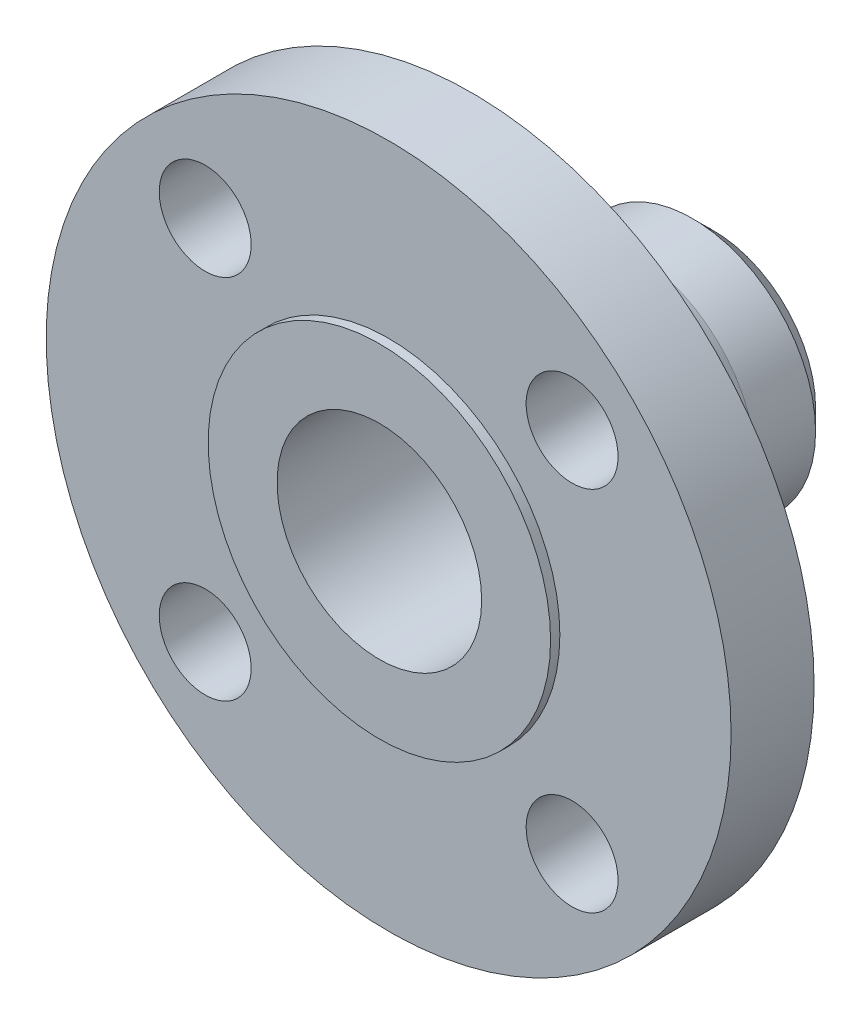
ISO-10303-21;
HEADER;
FILE_DESCRIPTION(('STEP AP214'),'2;1');
FILE_NAME('part.step','',(''),(''),'','','');
FILE_SCHEMA(('AUTOMOTIVE_DESIGN { 1 0 10303 214 1 1 1 1 }'));
ENDSEC;
DATA;
#1=APPLICATION_CONTEXT('core data for automotive mechanical design processes');
#2=APPLICATION_PROTOCOL_DEFINITION('international standard','automotive_design',2000,#1);
#3=PRODUCT_CONTEXT('',#1,'mechanical');
#4=PRODUCT('Part','Part','',(#3));
#5=PRODUCT_RELATED_PRODUCT_CATEGORY('part','',(#4));
#6=PRODUCT_DEFINITION_FORMATION('','',#4);
#7=PRODUCT_DEFINITION_CONTEXT('part definition',#1,'design');
#8=PRODUCT_DEFINITION('design','',#6,#7);
#9=PRODUCT_DEFINITION_SHAPE('','',#8);
#10=(LENGTH_UNIT() NAMED_UNIT(*) SI_UNIT(.MILLI.,.METRE.));
#11=(NAMED_UNIT(*) PLANE_ANGLE_UNIT() SI_UNIT($,.RADIAN.));
#12=(NAMED_UNIT(*) SI_UNIT($,.STERADIAN.) SOLID_ANGLE_UNIT());
#13=UNCERTAINTY_MEASURE_WITH_UNIT(LENGTH_MEASURE(1.E-05),#10,'distance_accuracy_value','');
#14=(GEOMETRIC_REPRESENTATION_CONTEXT(3) GLOBAL_UNCERTAINTY_ASSIGNED_CONTEXT((#13)) GLOBAL_UNIT_ASSIGNED_CONTEXT((#10,
#11,#12)) REPRESENTATION_CONTEXT('',''));
#15=CARTESIAN_POINT('',(0.,0.,0.));
#16=DIRECTION('',(0.,0.,1.));
#17=DIRECTION('',(1.,0.,0.));
#18=AXIS2_PLACEMENT_3D('',#15,#16,#17);
#19=CARTESIAN_POINT('',(0.,0.,1.5875));
#20=DIRECTION('',(0.,0.,1.));
#21=DIRECTION('',(1.,0.,0.));
#22=AXIS2_PLACEMENT_3D('',#19,#20,#21);
#23=PLANE('',#22);
#24=CARTESIAN_POINT('',(0.,0.,1.5875));
#25=DIRECTION('',(0.,0.,1.));
#26=DIRECTION('',(1.,0.,0.));
#27=AXIS2_PLACEMENT_3D('',#24,#25,#26);
#28=CIRCLE('',#27,29.337);
#29=CARTESIAN_POINT('',(29.337,0.,1.5875));
#30=VERTEX_POINT('',#29);
#31=EDGE_CURVE('E40',#30,#30,#28,.T.);
#32=ORIENTED_EDGE('',*,*,#31,.T.);
#33=EDGE_LOOP('',(#32));
#34=FACE_BOUND('',#33,.T.);
#35=CARTESIAN_POINT('',(0.,0.,1.5875));
#36=DIRECTION('',(0.,0.,1.));
#37=DIRECTION('',(1.,0.,0.));
#38=AXIS2_PLACEMENT_3D('',#35,#36,#37);
#39=CIRCLE('',#38,17.526);
#40=CARTESIAN_POINT('',(17.526,0.,1.5875));
#41=VERTEX_POINT('',#40);
#42=EDGE_CURVE('E61',#41,#41,#39,.T.);
#43=ORIENTED_EDGE('',*,*,#42,.F.);
#44=EDGE_LOOP('',(#43));
#45=FACE_BOUND('',#44,.T.);
#46=ADVANCED_FACE('F32',(#34,#45),#23,.T.);
#47=CARTESIAN_POINT('',(0.,0.,1.5875));
#48=DIRECTION('',(0.,0.,-1.));
#49=DIRECTION('',(-1.,0.,0.));
#50=AXIS2_PLACEMENT_3D('',#47,#48,#49);
#51=CYLINDRICAL_SURFACE('',#50,29.337);
#52=ORIENTED_EDGE('',*,*,#31,.F.);
#53=EDGE_LOOP('',(#52));
#54=FACE_BOUND('',#53,.T.);
#55=CARTESIAN_POINT('',(0.,0.,0.));
#56=DIRECTION('',(0.,0.,1.));
#57=DIRECTION('',(1.,0.,0.));
#58=AXIS2_PLACEMENT_3D('',#55,#56,#57);
#59=CIRCLE('',#58,29.337);
#60=CARTESIAN_POINT('',(29.337,0.,0.));
#61=VERTEX_POINT('',#60);
#62=EDGE_CURVE('E44',#61,#61,#59,.T.);
#63=ORIENTED_EDGE('',*,*,#62,.T.);
#64=EDGE_LOOP('',(#63));
#65=FACE_BOUND('',#64,.T.);
#66=ADVANCED_FACE('F96',(#54,#65),#51,.T.);
#67=CARTESIAN_POINT('',(0.,0.,0.));
#68=DIRECTION('',(0.,0.,1.));
#69=DIRECTION('',(1.,0.,0.));
#70=AXIS2_PLACEMENT_3D('',#67,#68,#69);
#71=PLANE('',#70);
#72=CARTESIAN_POINT('',(31.4308964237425,-31.4308964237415,0.));
#73=DIRECTION('',(0.,0.,1.));
#74=DIRECTION('',(0.,-1.,0.));
#75=AXIS2_PLACEMENT_3D('',#72,#73,#74);
#76=CIRCLE('',#75,7.87400000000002);
#77=CARTESIAN_POINT('',(31.4308964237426,-39.3048964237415,0.));
#78=VERTEX_POINT('',#77);
#79=EDGE_CURVE('E85',#78,#78,#76,.T.);
#80=ORIENTED_EDGE('',*,*,#79,.F.);
#81=EDGE_LOOP('',(#80));
#82=FACE_BOUND('',#81,.T.);
#83=CARTESIAN_POINT('',(-31.4308964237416,-31.4308964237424,0.));
#84=DIRECTION('',(0.,0.,1.));
#85=DIRECTION('',(-1.,0.,0.));
#86=AXIS2_PLACEMENT_3D('',#83,#84,#85);
#87=CIRCLE('',#86,7.87400000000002);
#88=CARTESIAN_POINT('',(-39.3048964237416,-31.4308964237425,0.));
#89=VERTEX_POINT('',#88);
#90=EDGE_CURVE('E79',#89,#89,#87,.T.);
#91=ORIENTED_EDGE('',*,*,#90,.F.);
#92=EDGE_LOOP('',(#91));
#93=FACE_BOUND('',#92,.T.);
#94=CARTESIAN_POINT('',(-31.4308964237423,31.4308964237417,0.));
#95=DIRECTION('',(0.,0.,1.));
#96=DIRECTION('',(0.,1.,0.));
#97=AXIS2_PLACEMENT_3D('',#94,#95,#96);
#98=CIRCLE('',#97,7.87400000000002);
#99=CARTESIAN_POINT('',(-31.4308964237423,39.3048964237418,0.));
#100=VERTEX_POINT('',#99);
#101=EDGE_CURVE('E73',#100,#100,#98,.T.);
#102=ORIENTED_EDGE('',*,*,#101,.F.);
#103=EDGE_LOOP('',(#102));
#104=FACE_BOUND('',#103,.T.);
#105=CARTESIAN_POINT('',(31.4308964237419,31.4308964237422,0.));
#106=DIRECTION('',(0.,0.,1.));
#107=DIRECTION('',(1.,0.,0.));
#108=AXIS2_PLACEMENT_3D('',#105,#106,#107);
#109=CIRCLE('',#108,7.87400000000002);
#110=CARTESIAN_POINT('',(39.3048964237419,31.4308964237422,0.));
#111=VERTEX_POINT('',#110);
#112=EDGE_CURVE('E67',#111,#111,#109,.T.);
#113=ORIENTED_EDGE('',*,*,#112,.F.);
#114=EDGE_LOOP('',(#113));
#115=FACE_BOUND('',#114,.T.);
#116=CARTESIAN_POINT('',(0.,0.,0.));
#117=DIRECTION('',(0.,0.,1.));
#118=DIRECTION('',(1.,0.,0.));
#119=AXIS2_PLACEMENT_3D('',#116,#117,#118);
#120=CIRCLE('',#119,58.674);
#121=CARTESIAN_POINT('',(58.674,0.,0.));
#122=VERTEX_POINT('',#121);
#123=EDGE_CURVE('E52',#122,#122,#120,.T.);
#124=ORIENTED_EDGE('',*,*,#123,.T.);
#125=EDGE_LOOP('',(#124));
#126=FACE_BOUND('',#125,.T.);
#127=ORIENTED_EDGE('',*,*,#62,.F.);
#128=EDGE_LOOP('',(#127));
#129=FACE_BOUND('',#128,.T.);
#130=ADVANCED_FACE('F92',(#82,#93,#104,#115,#126,#129),#71,.T.);
#131=CARTESIAN_POINT('',(0.,0.,-180.179133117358));
#132=DIRECTION('',(0.,0.,1.));
#133=DIRECTION('',(1.,0.,0.));
#134=AXIS2_PLACEMENT_3D('',#131,#132,#133);
#135=CYLINDRICAL_SURFACE('',#134,58.674);
#136=CARTESIAN_POINT('',(0.,0.,-14.224));
#137=DIRECTION('',(0.,0.,1.));
#138=DIRECTION('',(1.,0.,0.));
#139=AXIS2_PLACEMENT_3D('',#136,#137,#138);
#140=CIRCLE('',#139,58.674);
#141=CARTESIAN_POINT('',(58.674,0.,-14.224));
#142=VERTEX_POINT('',#141);
#143=EDGE_CURVE('E49',#142,#142,#140,.F.);
#144=ORIENTED_EDGE('',*,*,#143,.F.);
#145=EDGE_LOOP('',(#144));
#146=FACE_BOUND('',#145,.T.);
#147=ORIENTED_EDGE('',*,*,#123,.F.);
#148=EDGE_LOOP('',(#147));
#149=FACE_BOUND('',#148,.T.);
#150=ADVANCED_FACE('F95',(#146,#149),#135,.T.);
#151=CARTESIAN_POINT('',(0.,0.,-14.224));
#152=DIRECTION('',(0.,0.,1.));
#153=DIRECTION('',(1.,0.,0.));
#154=AXIS2_PLACEMENT_3D('',#151,#152,#153);
#155=PLANE('',#154);
#156=CARTESIAN_POINT('',(31.4308964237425,-31.4308964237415,-14.224));
#157=DIRECTION('',(0.,0.,1.));
#158=DIRECTION('',(0.,-1.,0.));
#159=AXIS2_PLACEMENT_3D('',#156,#157,#158);
#160=CIRCLE('',#159,7.87400000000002);
#161=CARTESIAN_POINT('',(31.4308964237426,-39.3048964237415,-14.224));
#162=VERTEX_POINT('',#161);
#163=EDGE_CURVE('E82',#162,#162,#160,.T.);
#164=ORIENTED_EDGE('',*,*,#163,.T.);
#165=EDGE_LOOP('',(#164));
#166=FACE_BOUND('',#165,.T.);
#167=CARTESIAN_POINT('',(-31.4308964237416,-31.4308964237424,-14.224));
#168=DIRECTION('',(0.,0.,1.));
#169=DIRECTION('',(-1.,0.,0.));
#170=AXIS2_PLACEMENT_3D('',#167,#168,#169);
#171=CIRCLE('',#170,7.87400000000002);
#172=CARTESIAN_POINT('',(-39.3048964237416,-31.4308964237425,-14.224));
#173=VERTEX_POINT('',#172);
#174=EDGE_CURVE('E76',#173,#173,#171,.T.);
#175=ORIENTED_EDGE('',*,*,#174,.T.);
#176=EDGE_LOOP('',(#175));
#177=FACE_BOUND('',#176,.T.);
#178=CARTESIAN_POINT('',(-31.4308964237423,31.4308964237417,-14.224));
#179=DIRECTION('',(0.,0.,1.));
#180=DIRECTION('',(0.,1.,0.));
#181=AXIS2_PLACEMENT_3D('',#178,#179,#180);
#182=CIRCLE('',#181,7.87400000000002);
#183=CARTESIAN_POINT('',(-31.4308964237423,39.3048964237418,-14.224));
#184=VERTEX_POINT('',#183);
#185=EDGE_CURVE('E70',#184,#184,#182,.T.);
#186=ORIENTED_EDGE('',*,*,#185,.T.);
#187=EDGE_LOOP('',(#186));
#188=FACE_BOUND('',#187,.T.);
#189=CARTESIAN_POINT('',(31.4308964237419,31.4308964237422,-14.224));
#190=DIRECTION('',(0.,0.,1.));
#191=DIRECTION('',(1.,0.,0.));
#192=AXIS2_PLACEMENT_3D('',#189,#190,#191);
#193=CIRCLE('',#192,7.87400000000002);
#194=CARTESIAN_POINT('',(39.3048964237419,31.4308964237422,-14.224));
#195=VERTEX_POINT('',#194);
#196=EDGE_CURVE('E36',#195,#195,#193,.T.);
#197=ORIENTED_EDGE('',*,*,#196,.T.);
#198=EDGE_LOOP('',(#197));
#199=FACE_BOUND('',#198,.T.);
#200=CARTESIAN_POINT('',(0.,0.,-14.224));
#201=DIRECTION('',(0.,0.,-1.));
#202=DIRECTION('',(-1.,0.,0.));
#203=AXIS2_PLACEMENT_3D('',#200,#201,#202);
#204=CIRCLE('',#203,29.337);
#205=CARTESIAN_POINT('',(-27.208458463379,10.9708412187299,-14.224));
#206=VERTEX_POINT('',#205);
#207=EDGE_CURVE('E55',#206,#206,#204,.T.);
#208=ORIENTED_EDGE('',*,*,#207,.F.);
#209=EDGE_LOOP('',(#208));
#210=FACE_BOUND('',#209,.T.);
#211=ORIENTED_EDGE('',*,*,#143,.T.);
#212=EDGE_LOOP('',(#211));
#213=FACE_BOUND('',#212,.T.);
#214=ADVANCED_FACE('F118',(#166,#177,#188,#199,#210,#213),#155,.F.);
#215=CARTESIAN_POINT('',(-15.8138415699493,13.9417767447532,-41.8253333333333));
#216=CARTESIAN_POINT('',(-27.208458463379,10.9708412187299,-14.224));
#217=CARTESIAN_POINT('',(-43.6973950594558,-17.6859063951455,-41.8253333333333));
#218=CARTESIAN_POINT('',(-49.1501409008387,-43.446075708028,-14.224));
#219=CARTESIAN_POINT('',(-12.0697119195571,-45.569459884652,-41.8253333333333));
#220=CARTESIAN_POINT('',(5.26677602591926,-65.3877581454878,-14.224));
#221=CARTESIAN_POINT('',(15.8138415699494,-13.9417767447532,-41.8253333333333));
#222=CARTESIAN_POINT('',(27.208458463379,-10.9708412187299,-14.224));
#223=CARTESIAN_POINT('',(43.6973950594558,17.6859063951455,-41.8253333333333));
#224=CARTESIAN_POINT('',(49.1501409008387,43.4460757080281,-14.224));
#225=CARTESIAN_POINT('',(12.0697119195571,45.5694598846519,-41.8253333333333));
#226=CARTESIAN_POINT('',(-5.26677602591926,65.3877581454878,-14.224));
#227=CARTESIAN_POINT('',(-15.8138415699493,13.9417767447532,-41.8253333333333));
#228=CARTESIAN_POINT('',(-27.208458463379,10.9708412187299,-14.224));
#229=(BOUNDED_SURFACE() B_SPLINE_SURFACE(3,1,((#215,#216),(#217,#218),(#219,#220),(#221,#222),
(#223,#224),(#225,#226),(#227,#228)),.UNSPECIFIED.,.T.,.F.,.F.) B_SPLINE_SURFACE_WITH_KNOTS((4,
3,4),(2,2),(0.,0.5,1.),(0.,1.),
.UNSPECIFIED.) GEOMETRIC_REPRESENTATION_ITEM() RATIONAL_B_SPLINE_SURFACE(((1.,1.),
(0.333333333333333,0.333333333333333),(0.333333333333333,0.333333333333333),(1.,1.),
(0.333333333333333,0.333333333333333),(0.333333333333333,0.333333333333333),(1.,1.))) REPRESENTATION_ITEM('') SURFACE());
#230=CARTESIAN_POINT('',(0.,0.,-41.8253333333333));
#231=DIRECTION('',(0.,0.,-1.));
#232=DIRECTION('',(-1.,0.,0.));
#233=AXIS2_PLACEMENT_3D('',#230,#231,#232);
#234=CIRCLE('',#233,21.082);
#235=CARTESIAN_POINT('',(-15.8138415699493,13.9417767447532,-41.8253333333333));
#236=VERTEX_POINT('',#235);
#237=EDGE_CURVE('E58',#236,#236,#234,.T.);
#238=CARTESIAN_POINT('',(-15.8138415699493,13.9417767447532,-41.8253333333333));
#239=CARTESIAN_POINT('',(-15.9325354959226,13.9108294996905,-41.5378194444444));
#240=CARTESIAN_POINT('',(-16.0512294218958,13.8798822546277,-41.2503055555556));
#241=CARTESIAN_POINT('',(-16.2886172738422,13.8179877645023,-40.6752777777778));
#242=CARTESIAN_POINT('',(-16.4073111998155,13.7870405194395,-40.3877638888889));
#243=CARTESIAN_POINT('',(-16.6446990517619,13.725146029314,-39.8127361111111));
#244=CARTESIAN_POINT('',(-16.7633929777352,13.6941987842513,-39.5252222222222));
#245=CARTESIAN_POINT('',(-17.0007808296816,13.6323042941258,-38.9501944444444));
#246=CARTESIAN_POINT('',(-17.1194747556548,13.6013570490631,-38.6626805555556));
#247=CARTESIAN_POINT('',(-17.3568626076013,13.5394625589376,-38.0876527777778));
#248=CARTESIAN_POINT('',(-17.4755565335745,13.5085153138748,-37.8001388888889));
#249=CARTESIAN_POINT('',(-17.7129443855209,13.4466208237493,-37.2251111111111));
#250=CARTESIAN_POINT('',(-17.8316383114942,13.4156735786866,-36.9375972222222));
#251=CARTESIAN_POINT('',(-18.0690261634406,13.3537790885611,-36.3625694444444));
#252=CARTESIAN_POINT('',(-18.1877200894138,13.3228318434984,-36.0750555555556));
#253=CARTESIAN_POINT('',(-18.4251079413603,13.2609373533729,-35.5000277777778));
#254=CARTESIAN_POINT('',(-18.5438018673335,13.2299901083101,-35.2125138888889));
#255=CARTESIAN_POINT('',(-18.78118971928,13.1680956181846,-34.6374861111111));
#256=CARTESIAN_POINT('',(-18.8998836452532,13.1371483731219,-34.3499722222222));
#257=CARTESIAN_POINT('',(-19.1372714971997,13.0752538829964,-33.7749444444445));
#258=CARTESIAN_POINT('',(-19.2559654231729,13.0443066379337,-33.4874305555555));
#259=CARTESIAN_POINT('',(-19.4933532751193,12.9824121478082,-32.9124027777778));
#260=CARTESIAN_POINT('',(-19.6120472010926,12.9514649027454,-32.6248888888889));
#261=CARTESIAN_POINT('',(-19.849435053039,12.88957041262,-32.0498611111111));
#262=CARTESIAN_POINT('',(-19.9681289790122,12.8586231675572,-31.7623472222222));
#263=CARTESIAN_POINT('',(-20.2055168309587,12.7967286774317,-31.1873194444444));
#264=CARTESIAN_POINT('',(-20.3242107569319,12.765781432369,-30.8998055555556));
#265=CARTESIAN_POINT('',(-20.5615986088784,12.7038869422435,-30.3247777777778));
#266=CARTESIAN_POINT('',(-20.6802925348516,12.6729396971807,-30.0372638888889));
#267=CARTESIAN_POINT('',(-20.917680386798,12.6110452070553,-29.4622361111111));
#268=CARTESIAN_POINT('',(-21.0363743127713,12.5800979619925,-29.1747222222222));
#269=CARTESIAN_POINT('',(-21.2737621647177,12.518203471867,-28.5996944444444));
#270=CARTESIAN_POINT('',(-21.3924560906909,12.4872562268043,-28.3121805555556));
#271=CARTESIAN_POINT('',(-21.6298439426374,12.4253617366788,-27.7371527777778));
#272=CARTESIAN_POINT('',(-21.7485378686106,12.3944144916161,-27.4496388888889));
#273=CARTESIAN_POINT('',(-21.9859257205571,12.3325200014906,-26.8746111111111));
#274=CARTESIAN_POINT('',(-22.1046196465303,12.3015727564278,-26.5870972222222));
#275=CARTESIAN_POINT('',(-22.3420074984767,12.2396782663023,-26.0120694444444));
#276=CARTESIAN_POINT('',(-22.46070142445,12.2087310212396,-25.7245555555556));
#277=CARTESIAN_POINT('',(-22.6980892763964,12.1468365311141,-25.1495277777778));
#278=CARTESIAN_POINT('',(-22.8167832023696,12.1158892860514,-24.8620138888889));
#279=CARTESIAN_POINT('',(-23.0541710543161,12.0539947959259,-24.2869861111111));
#280=CARTESIAN_POINT('',(-23.1728649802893,12.0230475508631,-23.9994722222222));
#281=CARTESIAN_POINT('',(-23.4102528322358,11.9611530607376,-23.4244444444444));
#282=CARTESIAN_POINT('',(-23.528946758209,11.9302058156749,-23.1369305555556));
#283=CARTESIAN_POINT('',(-23.7663346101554,11.8683113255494,-22.5619027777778));
#284=CARTESIAN_POINT('',(-23.8850285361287,11.8373640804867,-22.2743888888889));
#285=CARTESIAN_POINT('',(-24.1224163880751,11.7754695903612,-21.6993611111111));
#286=CARTESIAN_POINT('',(-24.2411103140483,11.7445223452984,-21.4118472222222));
#287=CARTESIAN_POINT('',(-24.4784981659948,11.682627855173,-20.8368194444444));
#288=CARTESIAN_POINT('',(-24.597192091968,11.6516806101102,-20.5493055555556));
#289=CARTESIAN_POINT('',(-24.8345799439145,11.5897861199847,-19.9742777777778));
#290=CARTESIAN_POINT('',(-24.9532738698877,11.558838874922,-19.6867638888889));
#291=CARTESIAN_POINT('',(-25.1906617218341,11.4969443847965,-19.1117361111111));
#292=CARTESIAN_POINT('',(-25.3093556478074,11.4659971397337,-18.8242222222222));
#293=CARTESIAN_POINT('',(-25.5467434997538,11.4041026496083,-18.2491944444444));
#294=CARTESIAN_POINT('',(-25.665437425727,11.3731554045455,-17.9616805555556));
#295=CARTESIAN_POINT('',(-25.9028252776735,11.31126091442,-17.3866527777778));
#296=CARTESIAN_POINT('',(-26.0215192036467,11.2803136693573,-17.0991388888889));
#297=CARTESIAN_POINT('',(-26.2589070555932,11.2184191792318,-16.5241111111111));
#298=CARTESIAN_POINT('',(-26.3776009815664,11.1874719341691,-16.2365972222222));
#299=CARTESIAN_POINT('',(-26.6149888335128,11.1255774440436,-15.6615694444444));
#300=CARTESIAN_POINT('',(-26.7336827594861,11.0946301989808,-15.3740555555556));
#301=CARTESIAN_POINT('',(-26.9710706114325,11.0327357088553,-14.7990277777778));
#302=CARTESIAN_POINT('',(-27.0897645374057,11.0017884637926,-14.5115138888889));
#303=CARTESIAN_POINT('',(-27.208458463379,10.9708412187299,-14.224));
#304=B_SPLINE_CURVE_WITH_KNOTS('',3,(#238,#239,#240,#241,#242,#243,#244,#245,#246,#247,#248,
#249,#250,#251,#252,#253,#254,#255,#256,#257,#258,#259,#260,#261,#262,#263,#264,#265,#266,#267,
#268,#269,#270,#271,#272,#273,#274,#275,#276,#277,#278,#279,#280,#281,#282,#283,#284,#285,#286,
#287,#288,#289,#290,#291,#292,#293,#294,#295,#296,#297,#298,#299,#300,#301,#302,#303),
.UNSPECIFIED.,.F.,.F.,(4,2,2,2,2,2,2,2,2,2,2,2,2,2,2,2,2,2,2,2,2,2,2,2,2,2,2,2,2,2,2,2,4),(0.,
0.93775900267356,1.87551800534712,2.81327700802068,3.75103601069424,4.6887950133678,
5.62655401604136,6.56431301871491,7.50207202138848,8.43983102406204,9.3775900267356,
10.3153490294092,11.2531080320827,12.1908670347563,13.1286260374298,14.0663850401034,
15.004144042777,15.9419030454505,16.8796620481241,17.8174210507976,18.7551800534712,
19.6929390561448,20.6306980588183,21.5684570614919,22.5062160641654,23.443975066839,
24.3817340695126,25.3194930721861,26.2572520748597,27.1950110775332,28.1327700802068,
29.0705290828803,30.0082880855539),.UNSPECIFIED.);
#305=EDGE_CURVE('BSEAM123',#236,#206,#304,.T.);
#306=ORIENTED_EDGE('',*,*,#237,.F.);
#307=ORIENTED_EDGE('',*,*,#207,.T.);
#308=ORIENTED_EDGE('',*,*,#305,.T.);
#309=ORIENTED_EDGE('',*,*,#305,.F.);
#310=EDGE_LOOP('',(#306,#308,#307,#309));
#311=FACE_BOUND('',#310,.T.);
#312=ADVANCED_FACE('F123',(#311),#229,.T.);
#313=CARTESIAN_POINT('',(0.,0.,-115.254900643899));
#314=DIRECTION('',(0.,0.,1.));
#315=DIRECTION('',(1.,0.,0.));
#316=AXIS2_PLACEMENT_3D('',#313,#314,#315);
#317=CYLINDRICAL_SURFACE('',#316,21.082);
#318=CARTESIAN_POINT('',(0.,0.,-52.0699999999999));
#319=DIRECTION('',(0.,0.,1.));
#320=DIRECTION('',(1.,0.,0.));
#321=AXIS2_PLACEMENT_3D('',#318,#319,#320);
#322=CIRCLE('',#321,21.082);
#323=CARTESIAN_POINT('',(21.082,0.,-52.0699999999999));
#324=VERTEX_POINT('',#323);
#325=EDGE_CURVE('E10',#324,#324,#322,.T.);
#326=ORIENTED_EDGE('',*,*,#325,.T.);
#327=EDGE_LOOP('',(#326));
#328=FACE_BOUND('',#327,.T.);
#329=ORIENTED_EDGE('',*,*,#237,.T.);
#330=EDGE_LOOP('',(#329));
#331=FACE_BOUND('',#330,.T.);
#332=ADVANCED_FACE('F129',(#328,#331),#317,.T.);
#333=CARTESIAN_POINT('',(0.,0.,-52.0699999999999));
#334=DIRECTION('',(0.,0.,1.));
#335=DIRECTION('',(1.,0.,0.));
#336=AXIS2_PLACEMENT_3D('',#333,#334,#335);
#337=CONICAL_SURFACE('',#336,21.082,0.785398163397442);
#338=CARTESIAN_POINT('',(0.,0.,-55.626));
#339=DIRECTION('',(0.,0.,1.));
#340=DIRECTION('',(1.,0.,0.));
#341=AXIS2_PLACEMENT_3D('',#338,#339,#340);
#342=CIRCLE('',#341,17.526);
#343=CARTESIAN_POINT('',(17.526,0.,-55.626));
#344=VERTEX_POINT('',#343);
#345=EDGE_CURVE('E64',#344,#344,#342,.T.);
#346=CARTESIAN_POINT('',(17.526,0.,-55.626));
#347=CARTESIAN_POINT('',(17.5630416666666,0.,-55.5889583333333));
#348=CARTESIAN_POINT('',(17.6000833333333,0.,-55.5519166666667));
#349=CARTESIAN_POINT('',(17.6741666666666,0.,-55.4778333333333));
#350=CARTESIAN_POINT('',(17.7112083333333,0.,-55.4407916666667));
#351=CARTESIAN_POINT('',(17.7852916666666,0.,-55.3667083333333));
#352=CARTESIAN_POINT('',(17.8223333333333,0.,-55.3296666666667));
#353=CARTESIAN_POINT('',(17.8964166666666,0.,-55.2555833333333));
#354=CARTESIAN_POINT('',(17.9334583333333,0.,-55.2185416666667));
#355=CARTESIAN_POINT('',(18.0075416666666,0.,-55.1444583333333));
#356=CARTESIAN_POINT('',(18.0445833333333,0.,-55.1074166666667));
#357=CARTESIAN_POINT('',(18.1186666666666,0.,-55.0333333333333));
#358=CARTESIAN_POINT('',(18.1557083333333,0.,-54.9962916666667));
#359=CARTESIAN_POINT('',(18.2297916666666,0.,-54.9222083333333));
#360=CARTESIAN_POINT('',(18.2668333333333,0.,-54.8851666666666));
#361=CARTESIAN_POINT('',(18.3409166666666,0.,-54.8110833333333));
#362=CARTESIAN_POINT('',(18.3779583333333,0.,-54.7740416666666));
#363=CARTESIAN_POINT('',(18.4520416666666,0.,-54.6999583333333));
#364=CARTESIAN_POINT('',(18.4890833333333,0.,-54.6629166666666));
#365=CARTESIAN_POINT('',(18.5631666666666,0.,-54.5888333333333));
#366=CARTESIAN_POINT('',(18.6002083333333,0.,-54.5517916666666));
#367=CARTESIAN_POINT('',(18.6742916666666,0.,-54.4777083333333));
#368=CARTESIAN_POINT('',(18.7113333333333,0.,-54.4406666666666));
#369=CARTESIAN_POINT('',(18.7854166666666,0.,-54.3665833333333));
#370=CARTESIAN_POINT('',(18.8224583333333,0.,-54.3295416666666));
#371=CARTESIAN_POINT('',(18.8965416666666,0.,-54.2554583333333));
#372=CARTESIAN_POINT('',(18.9335833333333,0.,-54.2184166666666));
#373=CARTESIAN_POINT('',(19.0076666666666,0.,-54.1443333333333));
#374=CARTESIAN_POINT('',(19.0447083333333,0.,-54.1072916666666));
#375=CARTESIAN_POINT('',(19.1187916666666,0.,-54.0332083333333));
#376=CARTESIAN_POINT('',(19.1558333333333,0.,-53.9961666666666));
#377=CARTESIAN_POINT('',(19.2299166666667,0.,-53.9220833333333));
#378=CARTESIAN_POINT('',(19.2669583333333,0.,-53.8850416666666));
#379=CARTESIAN_POINT('',(19.3410416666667,0.,-53.8109583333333));
#380=CARTESIAN_POINT('',(19.3780833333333,0.,-53.7739166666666));
#381=CARTESIAN_POINT('',(19.4521666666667,0.,-53.6998333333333));
#382=CARTESIAN_POINT('',(19.4892083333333,0.,-53.6627916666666));
#383=CARTESIAN_POINT('',(19.5632916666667,0.,-53.5887083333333));
#384=CARTESIAN_POINT('',(19.6003333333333,0.,-53.5516666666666));
#385=CARTESIAN_POINT('',(19.6744166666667,0.,-53.4775833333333));
#386=CARTESIAN_POINT('',(19.7114583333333,0.,-53.4405416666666));
#387=CARTESIAN_POINT('',(19.7855416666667,0.,-53.3664583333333));
#388=CARTESIAN_POINT('',(19.8225833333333,0.,-53.3294166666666));
#389=CARTESIAN_POINT('',(19.8966666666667,0.,-53.2553333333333));
#390=CARTESIAN_POINT('',(19.9337083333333,0.,-53.2182916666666));
#391=CARTESIAN_POINT('',(20.0077916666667,0.,-53.1442083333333));
#392=CARTESIAN_POINT('',(20.0448333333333,0.,-53.1071666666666));
#393=CARTESIAN_POINT('',(20.1189166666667,0.,-53.0330833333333));
#394=CARTESIAN_POINT('',(20.1559583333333,0.,-52.9960416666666));
#395=CARTESIAN_POINT('',(20.2300416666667,0.,-52.9219583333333));
#396=CARTESIAN_POINT('',(20.2670833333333,0.,-52.8849166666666));
#397=CARTESIAN_POINT('',(20.3411666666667,0.,-52.8108333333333));
#398=CARTESIAN_POINT('',(20.3782083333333,0.,-52.7737916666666));
#399=CARTESIAN_POINT('',(20.4522916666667,0.,-52.6997083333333));
#400=CARTESIAN_POINT('',(20.4893333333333,0.,-52.6626666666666));
#401=CARTESIAN_POINT('',(20.5634166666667,0.,-52.5885833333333));
#402=CARTESIAN_POINT('',(20.6004583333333,0.,-52.5515416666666));
#403=CARTESIAN_POINT('',(20.6745416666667,0.,-52.4774583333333));
#404=CARTESIAN_POINT('',(20.7115833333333,0.,-52.4404166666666));
#405=CARTESIAN_POINT('',(20.7856666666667,0.,-52.3663333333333));
#406=CARTESIAN_POINT('',(20.8227083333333,0.,-52.3292916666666));
#407=CARTESIAN_POINT('',(20.8967916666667,0.,-52.2552083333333));
#408=CARTESIAN_POINT('',(20.9338333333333,0.,-52.2181666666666));
#409=CARTESIAN_POINT('',(21.0079166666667,0.,-52.1440833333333));
#410=CARTESIAN_POINT('',(21.0449583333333,0.,-52.1070416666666));
#411=CARTESIAN_POINT('',(21.082,0.,-52.0699999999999));
#412=B_SPLINE_CURVE_WITH_KNOTS('',3,(#346,#347,#348,#349,#350,#351,#352,#353,#354,#355,#356,
#357,#358,#359,#360,#361,#362,#363,#364,#365,#366,#367,#368,#369,#370,#371,#372,#373,#374,#375,
#376,#377,#378,#379,#380,#381,#382,#383,#384,#385,#386,#387,#388,#389,#390,#391,#392,#393,#394,
#395,#396,#397,#398,#399,#400,#401,#402,#403,#404,#405,#406,#407,#408,#409,#410,#411),
.UNSPECIFIED.,.F.,.F.,(4,2,2,2,2,2,2,2,2,2,2,2,2,2,2,2,2,2,2,2,2,2,2,2,2,2,2,2,2,2,2,2,4),(0.,
0.157154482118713,0.314308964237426,0.471463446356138,0.628617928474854,0.785772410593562,
0.942926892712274,1.10008137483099,1.2572358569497,1.41439033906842,1.57154482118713,
1.72869930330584,1.88585378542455,2.04300826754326,2.20016274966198,2.35731723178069,
2.5144717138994,2.67162619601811,2.82878067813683,2.98593516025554,3.14308964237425,
3.30024412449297,3.45739860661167,3.61455308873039,3.7717075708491,3.92886205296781,
4.08601653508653,4.24317101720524,4.40032549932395,4.55747998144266,4.71463446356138,
4.87178894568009,5.0289434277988),.UNSPECIFIED.);
#413=EDGE_CURVE('BSEAM34',#344,#324,#412,.T.);
#414=ORIENTED_EDGE('',*,*,#345,.T.);
#415=ORIENTED_EDGE('',*,*,#325,.F.);
#416=ORIENTED_EDGE('',*,*,#413,.T.);
#417=ORIENTED_EDGE('',*,*,#413,.F.);
#418=EDGE_LOOP('',(#414,#416,#415,#417));
#419=FACE_BOUND('',#418,.T.);
#420=ADVANCED_FACE('F34',(#419),#337,.T.);
#421=CARTESIAN_POINT('',(0.,0.,1.5885));
#422=DIRECTION('',(0.,0.,-1.));
#423=DIRECTION('',(-1.,0.,0.));
#424=AXIS2_PLACEMENT_3D('',#421,#422,#423);
#425=CYLINDRICAL_SURFACE('',#424,17.526);
#426=ORIENTED_EDGE('',*,*,#42,.T.);
#427=EDGE_LOOP('',(#426));
#428=FACE_BOUND('',#427,.T.);
#429=ORIENTED_EDGE('',*,*,#345,.F.);
#430=EDGE_LOOP('',(#429));
#431=FACE_BOUND('',#430,.T.);
#432=ADVANCED_FACE('F138',(#428,#431),#425,.F.);
#433=CARTESIAN_POINT('',(31.4308964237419,31.4308964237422,-55.626));
#434=DIRECTION('',(0.,0.,1.));
#435=DIRECTION('',(1.,0.,0.));
#436=AXIS2_PLACEMENT_3D('',#433,#434,#435);
#437=CYLINDRICAL_SURFACE('',#436,7.87400000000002);
#438=CARTESIAN_POINT('',(39.3048964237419,31.4308964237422,0.));
#439=CARTESIAN_POINT('',(39.3048964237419,31.4308964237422,-0.148166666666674));
#440=CARTESIAN_POINT('',(39.3048964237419,31.4308964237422,-0.296333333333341));
#441=CARTESIAN_POINT('',(39.3048964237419,31.4308964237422,-0.592666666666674));
#442=CARTESIAN_POINT('',(39.3048964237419,31.4308964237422,-0.740833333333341));
#443=CARTESIAN_POINT('',(39.3048964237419,31.4308964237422,-1.03716666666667));
#444=CARTESIAN_POINT('',(39.3048964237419,31.4308964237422,-1.18533333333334));
#445=CARTESIAN_POINT('',(39.3048964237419,31.4308964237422,-1.48166666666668));
#446=CARTESIAN_POINT('',(39.3048964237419,31.4308964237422,-1.62983333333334));
#447=CARTESIAN_POINT('',(39.3048964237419,31.4308964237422,-1.92616666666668));
#448=CARTESIAN_POINT('',(39.3048964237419,31.4308964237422,-2.07433333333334));
#449=CARTESIAN_POINT('',(39.3048964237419,31.4308964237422,-2.37066666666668));
#450=CARTESIAN_POINT('',(39.3048964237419,31.4308964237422,-2.51883333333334));
#451=CARTESIAN_POINT('',(39.3048964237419,31.4308964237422,-2.81516666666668));
#452=CARTESIAN_POINT('',(39.3048964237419,31.4308964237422,-2.96333333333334));
#453=CARTESIAN_POINT('',(39.3048964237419,31.4308964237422,-3.25966666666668));
#454=CARTESIAN_POINT('',(39.3048964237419,31.4308964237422,-3.40783333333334));
#455=CARTESIAN_POINT('',(39.3048964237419,31.4308964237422,-3.70416666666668));
#456=CARTESIAN_POINT('',(39.3048964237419,31.4308964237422,-3.85233333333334));
#457=CARTESIAN_POINT('',(39.3048964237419,31.4308964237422,-4.14866666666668));
#458=CARTESIAN_POINT('',(39.3048964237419,31.4308964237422,-4.29683333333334));
#459=CARTESIAN_POINT('',(39.3048964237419,31.4308964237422,-4.59316666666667));
#460=CARTESIAN_POINT('',(39.3048964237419,31.4308964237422,-4.74133333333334));
#461=CARTESIAN_POINT('',(39.3048964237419,31.4308964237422,-5.03766666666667));
#462=CARTESIAN_POINT('',(39.3048964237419,31.4308964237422,-5.18583333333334));
#463=CARTESIAN_POINT('',(39.3048964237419,31.4308964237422,-5.48216666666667));
#464=CARTESIAN_POINT('',(39.3048964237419,31.4308964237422,-5.63033333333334));
#465=CARTESIAN_POINT('',(39.3048964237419,31.4308964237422,-5.92666666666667));
#466=CARTESIAN_POINT('',(39.3048964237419,31.4308964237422,-6.07483333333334));
#467=CARTESIAN_POINT('',(39.3048964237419,31.4308964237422,-6.37116666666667));
#468=CARTESIAN_POINT('',(39.3048964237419,31.4308964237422,-6.51933333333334));
#469=CARTESIAN_POINT('',(39.3048964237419,31.4308964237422,-6.81566666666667));
#470=CARTESIAN_POINT('',(39.3048964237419,31.4308964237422,-6.96383333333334));
#471=CARTESIAN_POINT('',(39.3048964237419,31.4308964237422,-7.26016666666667));
#472=CARTESIAN_POINT('',(39.3048964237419,31.4308964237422,-7.40833333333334));
#473=CARTESIAN_POINT('',(39.3048964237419,31.4308964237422,-7.70466666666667));
#474=CARTESIAN_POINT('',(39.3048964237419,31.4308964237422,-7.85283333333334));
#475=CARTESIAN_POINT('',(39.3048964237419,31.4308964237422,-8.14916666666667));
#476=CARTESIAN_POINT('',(39.3048964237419,31.4308964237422,-8.29733333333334));
#477=CARTESIAN_POINT('',(39.3048964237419,31.4308964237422,-8.59366666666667));
#478=CARTESIAN_POINT('',(39.3048964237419,31.4308964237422,-8.74183333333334));
#479=CARTESIAN_POINT('',(39.3048964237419,31.4308964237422,-9.03816666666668));
#480=CARTESIAN_POINT('',(39.3048964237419,31.4308964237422,-9.18633333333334));
#481=CARTESIAN_POINT('',(39.3048964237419,31.4308964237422,-9.48266666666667));
#482=CARTESIAN_POINT('',(39.3048964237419,31.4308964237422,-9.63083333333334));
#483=CARTESIAN_POINT('',(39.3048964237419,31.4308964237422,-9.92716666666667));
#484=CARTESIAN_POINT('',(39.3048964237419,31.4308964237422,-10.0753333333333));
#485=CARTESIAN_POINT('',(39.3048964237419,31.4308964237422,-10.3716666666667));
#486=CARTESIAN_POINT('',(39.3048964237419,31.4308964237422,-10.5198333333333));
#487=CARTESIAN_POINT('',(39.3048964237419,31.4308964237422,-10.8161666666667));
#488=CARTESIAN_POINT('',(39.3048964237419,31.4308964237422,-10.9643333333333));
#489=CARTESIAN_POINT('',(39.3048964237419,31.4308964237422,-11.2606666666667));
#490=CARTESIAN_POINT('',(39.3048964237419,31.4308964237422,-11.4088333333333));
#491=CARTESIAN_POINT('',(39.3048964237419,31.4308964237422,-11.7051666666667));
#492=CARTESIAN_POINT('',(39.3048964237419,31.4308964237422,-11.8533333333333));
#493=CARTESIAN_POINT('',(39.3048964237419,31.4308964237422,-12.1496666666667));
#494=CARTESIAN_POINT('',(39.3048964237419,31.4308964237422,-12.2978333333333));
#495=CARTESIAN_POINT('',(39.3048964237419,31.4308964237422,-12.5941666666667));
#496=CARTESIAN_POINT('',(39.3048964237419,31.4308964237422,-12.7423333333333));
#497=CARTESIAN_POINT('',(39.3048964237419,31.4308964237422,-13.0386666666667));
#498=CARTESIAN_POINT('',(39.3048964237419,31.4308964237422,-13.1868333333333));
#499=CARTESIAN_POINT('',(39.3048964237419,31.4308964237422,-13.4831666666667));
#500=CARTESIAN_POINT('',(39.3048964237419,31.4308964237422,-13.6313333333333));
#501=CARTESIAN_POINT('',(39.3048964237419,31.4308964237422,-13.9276666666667));
#502=CARTESIAN_POINT('',(39.3048964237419,31.4308964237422,-14.0758333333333));
#503=CARTESIAN_POINT('',(39.3048964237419,31.4308964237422,-14.224));
#504=B_SPLINE_CURVE_WITH_KNOTS('',3,(#438,#439,#440,#441,#442,#443,#444,#445,#446,#447,#448,
#449,#450,#451,#452,#453,#454,#455,#456,#457,#458,#459,#460,#461,#462,#463,#464,#465,#466,#467,
#468,#469,#470,#471,#472,#473,#474,#475,#476,#477,#478,#479,#480,#481,#482,#483,#484,#485,#486,
#487,#488,#489,#490,#491,#492,#493,#494,#495,#496,#497,#498,#499,#500,#501,#502,#503),
.UNSPECIFIED.,.F.,.F.,(4,2,2,2,2,2,2,2,2,2,2,2,2,2,2,2,2,2,2,2,2,2,2,2,2,2,2,2,2,2,2,2,4),(0.,
0.4445,0.889000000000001,1.3335,1.778,2.2225,2.667,3.1115,3.556,4.0005,4.445,4.8895,5.334,
5.7785,6.223,6.6675,7.112,7.5565,8.001,8.4455,8.89,9.3345,9.779,10.2235,10.668,11.1125,11.557,
12.0015,12.446,12.8905,13.335,13.7795,14.224),.UNSPECIFIED.);
#505=EDGE_CURVE('BSEAM141',#111,#195,#504,.T.);
#506=ORIENTED_EDGE('',*,*,#112,.T.);
#507=ORIENTED_EDGE('',*,*,#196,.F.);
#508=ORIENTED_EDGE('',*,*,#505,.T.);
#509=ORIENTED_EDGE('',*,*,#505,.F.);
#510=EDGE_LOOP('',(#506,#508,#507,#509));
#511=FACE_BOUND('',#510,.T.);
#512=ADVANCED_FACE('F141',(#511),#437,.F.);
#513=CARTESIAN_POINT('',(-31.4308964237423,31.4308964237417,-55.626));
#514=DIRECTION('',(0.,0.,1.));
#515=DIRECTION('',(0.,1.,0.));
#516=AXIS2_PLACEMENT_3D('',#513,#514,#515);
#517=CYLINDRICAL_SURFACE('',#516,7.87400000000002);
#518=CARTESIAN_POINT('',(-31.4308964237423,39.3048964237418,0.));
#519=CARTESIAN_POINT('',(-31.4308964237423,39.3048964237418,-0.148166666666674));
#520=CARTESIAN_POINT('',(-31.4308964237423,39.3048964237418,-0.296333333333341));
#521=CARTESIAN_POINT('',(-31.4308964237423,39.3048964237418,-0.592666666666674));
#522=CARTESIAN_POINT('',(-31.4308964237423,39.3048964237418,-0.740833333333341));
#523=CARTESIAN_POINT('',(-31.4308964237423,39.3048964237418,-1.03716666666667));
#524=CARTESIAN_POINT('',(-31.4308964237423,39.3048964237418,-1.18533333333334));
#525=CARTESIAN_POINT('',(-31.4308964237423,39.3048964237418,-1.48166666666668));
#526=CARTESIAN_POINT('',(-31.4308964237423,39.3048964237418,-1.62983333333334));
#527=CARTESIAN_POINT('',(-31.4308964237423,39.3048964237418,-1.92616666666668));
#528=CARTESIAN_POINT('',(-31.4308964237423,39.3048964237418,-2.07433333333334));
#529=CARTESIAN_POINT('',(-31.4308964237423,39.3048964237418,-2.37066666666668));
#530=CARTESIAN_POINT('',(-31.4308964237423,39.3048964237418,-2.51883333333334));
#531=CARTESIAN_POINT('',(-31.4308964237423,39.3048964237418,-2.81516666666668));
#532=CARTESIAN_POINT('',(-31.4308964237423,39.3048964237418,-2.96333333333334));
#533=CARTESIAN_POINT('',(-31.4308964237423,39.3048964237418,-3.25966666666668));
#534=CARTESIAN_POINT('',(-31.4308964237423,39.3048964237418,-3.40783333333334));
#535=CARTESIAN_POINT('',(-31.4308964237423,39.3048964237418,-3.70416666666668));
#536=CARTESIAN_POINT('',(-31.4308964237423,39.3048964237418,-3.85233333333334));
#537=CARTESIAN_POINT('',(-31.4308964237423,39.3048964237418,-4.14866666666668));
#538=CARTESIAN_POINT('',(-31.4308964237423,39.3048964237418,-4.29683333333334));
#539=CARTESIAN_POINT('',(-31.4308964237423,39.3048964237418,-4.59316666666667));
#540=CARTESIAN_POINT('',(-31.4308964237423,39.3048964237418,-4.74133333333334));
#541=CARTESIAN_POINT('',(-31.4308964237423,39.3048964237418,-5.03766666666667));
#542=CARTESIAN_POINT('',(-31.4308964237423,39.3048964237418,-5.18583333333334));
#543=CARTESIAN_POINT('',(-31.4308964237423,39.3048964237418,-5.48216666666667));
#544=CARTESIAN_POINT('',(-31.4308964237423,39.3048964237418,-5.63033333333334));
#545=CARTESIAN_POINT('',(-31.4308964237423,39.3048964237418,-5.92666666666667));
#546=CARTESIAN_POINT('',(-31.4308964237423,39.3048964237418,-6.07483333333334));
#547=CARTESIAN_POINT('',(-31.4308964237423,39.3048964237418,-6.37116666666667));
#548=CARTESIAN_POINT('',(-31.4308964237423,39.3048964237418,-6.51933333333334));
#549=CARTESIAN_POINT('',(-31.4308964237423,39.3048964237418,-6.81566666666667));
#550=CARTESIAN_POINT('',(-31.4308964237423,39.3048964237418,-6.96383333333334));
#551=CARTESIAN_POINT('',(-31.4308964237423,39.3048964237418,-7.26016666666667));
#552=CARTESIAN_POINT('',(-31.4308964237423,39.3048964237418,-7.40833333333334));
#553=CARTESIAN_POINT('',(-31.4308964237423,39.3048964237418,-7.70466666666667));
#554=CARTESIAN_POINT('',(-31.4308964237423,39.3048964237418,-7.85283333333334));
#555=CARTESIAN_POINT('',(-31.4308964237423,39.3048964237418,-8.14916666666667));
#556=CARTESIAN_POINT('',(-31.4308964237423,39.3048964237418,-8.29733333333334));
#557=CARTESIAN_POINT('',(-31.4308964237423,39.3048964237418,-8.59366666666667));
#558=CARTESIAN_POINT('',(-31.4308964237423,39.3048964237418,-8.74183333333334));
#559=CARTESIAN_POINT('',(-31.4308964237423,39.3048964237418,-9.03816666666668));
#560=CARTESIAN_POINT('',(-31.4308964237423,39.3048964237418,-9.18633333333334));
#561=CARTESIAN_POINT('',(-31.4308964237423,39.3048964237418,-9.48266666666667));
#562=CARTESIAN_POINT('',(-31.4308964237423,39.3048964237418,-9.63083333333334));
#563=CARTESIAN_POINT('',(-31.4308964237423,39.3048964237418,-9.92716666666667));
#564=CARTESIAN_POINT('',(-31.4308964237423,39.3048964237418,-10.0753333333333));
#565=CARTESIAN_POINT('',(-31.4308964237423,39.3048964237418,-10.3716666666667));
#566=CARTESIAN_POINT('',(-31.4308964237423,39.3048964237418,-10.5198333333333));
#567=CARTESIAN_POINT('',(-31.4308964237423,39.3048964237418,-10.8161666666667));
#568=CARTESIAN_POINT('',(-31.4308964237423,39.3048964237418,-10.9643333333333));
#569=CARTESIAN_POINT('',(-31.4308964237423,39.3048964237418,-11.2606666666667));
#570=CARTESIAN_POINT('',(-31.4308964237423,39.3048964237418,-11.4088333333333));
#571=CARTESIAN_POINT('',(-31.4308964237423,39.3048964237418,-11.7051666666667));
#572=CARTESIAN_POINT('',(-31.4308964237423,39.3048964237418,-11.8533333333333));
#573=CARTESIAN_POINT('',(-31.4308964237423,39.3048964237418,-12.1496666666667));
#574=CARTESIAN_POINT('',(-31.4308964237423,39.3048964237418,-12.2978333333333));
#575=CARTESIAN_POINT('',(-31.4308964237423,39.3048964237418,-12.5941666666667));
#576=CARTESIAN_POINT('',(-31.4308964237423,39.3048964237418,-12.7423333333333));
#577=CARTESIAN_POINT('',(-31.4308964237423,39.3048964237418,-13.0386666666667));
#578=CARTESIAN_POINT('',(-31.4308964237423,39.3048964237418,-13.1868333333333));
#579=CARTESIAN_POINT('',(-31.4308964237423,39.3048964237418,-13.4831666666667));
#580=CARTESIAN_POINT('',(-31.4308964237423,39.3048964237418,-13.6313333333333));
#581=CARTESIAN_POINT('',(-31.4308964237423,39.3048964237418,-13.9276666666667));
#582=CARTESIAN_POINT('',(-31.4308964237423,39.3048964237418,-14.0758333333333));
#583=CARTESIAN_POINT('',(-31.4308964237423,39.3048964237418,-14.224));
#584=B_SPLINE_CURVE_WITH_KNOTS('',3,(#518,#519,#520,#521,#522,#523,#524,#525,#526,#527,#528,
#529,#530,#531,#532,#533,#534,#535,#536,#537,#538,#539,#540,#541,#542,#543,#544,#545,#546,#547,
#548,#549,#550,#551,#552,#553,#554,#555,#556,#557,#558,#559,#560,#561,#562,#563,#564,#565,#566,
#567,#568,#569,#570,#571,#572,#573,#574,#575,#576,#577,#578,#579,#580,#581,#582,#583),
.UNSPECIFIED.,.F.,.F.,(4,2,2,2,2,2,2,2,2,2,2,2,2,2,2,2,2,2,2,2,2,2,2,2,2,2,2,2,2,2,2,2,4),(0.,
0.4445,0.889000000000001,1.3335,1.778,2.2225,2.667,3.1115,3.556,4.0005,4.445,4.8895,5.334,
5.7785,6.223,6.6675,7.112,7.5565,8.001,8.4455,8.89,9.3345,9.779,10.2235,10.668,11.1125,11.557,
12.0015,12.446,12.8905,13.335,13.7795,14.224),.UNSPECIFIED.);
#585=EDGE_CURVE('BSEAM145',#100,#184,#584,.T.);
#586=ORIENTED_EDGE('',*,*,#101,.T.);
#587=ORIENTED_EDGE('',*,*,#185,.F.);
#588=ORIENTED_EDGE('',*,*,#585,.T.);
#589=ORIENTED_EDGE('',*,*,#585,.F.);
#590=EDGE_LOOP('',(#586,#588,#587,#589));
#591=FACE_BOUND('',#590,.T.);
#592=ADVANCED_FACE('F145',(#591),#517,.F.);
#593=CARTESIAN_POINT('',(-31.4308964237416,-31.4308964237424,-55.626));
#594=DIRECTION('',(0.,0.,1.));
#595=DIRECTION('',(-1.,0.,0.));
#596=AXIS2_PLACEMENT_3D('',#593,#594,#595);
#597=CYLINDRICAL_SURFACE('',#596,7.87400000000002);
#598=CARTESIAN_POINT('',(-39.3048964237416,-31.4308964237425,0.));
#599=CARTESIAN_POINT('',(-39.3048964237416,-31.4308964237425,-0.148166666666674));
#600=CARTESIAN_POINT('',(-39.3048964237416,-31.4308964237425,-0.296333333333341));
#601=CARTESIAN_POINT('',(-39.3048964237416,-31.4308964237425,-0.592666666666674));
#602=CARTESIAN_POINT('',(-39.3048964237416,-31.4308964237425,-0.740833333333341));
#603=CARTESIAN_POINT('',(-39.3048964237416,-31.4308964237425,-1.03716666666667));
#604=CARTESIAN_POINT('',(-39.3048964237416,-31.4308964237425,-1.18533333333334));
#605=CARTESIAN_POINT('',(-39.3048964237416,-31.4308964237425,-1.48166666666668));
#606=CARTESIAN_POINT('',(-39.3048964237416,-31.4308964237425,-1.62983333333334));
#607=CARTESIAN_POINT('',(-39.3048964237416,-31.4308964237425,-1.92616666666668));
#608=CARTESIAN_POINT('',(-39.3048964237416,-31.4308964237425,-2.07433333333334));
#609=CARTESIAN_POINT('',(-39.3048964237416,-31.4308964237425,-2.37066666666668));
#610=CARTESIAN_POINT('',(-39.3048964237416,-31.4308964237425,-2.51883333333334));
#611=CARTESIAN_POINT('',(-39.3048964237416,-31.4308964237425,-2.81516666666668));
#612=CARTESIAN_POINT('',(-39.3048964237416,-31.4308964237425,-2.96333333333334));
#613=CARTESIAN_POINT('',(-39.3048964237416,-31.4308964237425,-3.25966666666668));
#614=CARTESIAN_POINT('',(-39.3048964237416,-31.4308964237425,-3.40783333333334));
#615=CARTESIAN_POINT('',(-39.3048964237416,-31.4308964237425,-3.70416666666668));
#616=CARTESIAN_POINT('',(-39.3048964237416,-31.4308964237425,-3.85233333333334));
#617=CARTESIAN_POINT('',(-39.3048964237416,-31.4308964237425,-4.14866666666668));
#618=CARTESIAN_POINT('',(-39.3048964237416,-31.4308964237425,-4.29683333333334));
#619=CARTESIAN_POINT('',(-39.3048964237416,-31.4308964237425,-4.59316666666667));
#620=CARTESIAN_POINT('',(-39.3048964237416,-31.4308964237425,-4.74133333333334));
#621=CARTESIAN_POINT('',(-39.3048964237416,-31.4308964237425,-5.03766666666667));
#622=CARTESIAN_POINT('',(-39.3048964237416,-31.4308964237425,-5.18583333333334));
#623=CARTESIAN_POINT('',(-39.3048964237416,-31.4308964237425,-5.48216666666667));
#624=CARTESIAN_POINT('',(-39.3048964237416,-31.4308964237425,-5.63033333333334));
#625=CARTESIAN_POINT('',(-39.3048964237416,-31.4308964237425,-5.92666666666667));
#626=CARTESIAN_POINT('',(-39.3048964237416,-31.4308964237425,-6.07483333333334));
#627=CARTESIAN_POINT('',(-39.3048964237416,-31.4308964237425,-6.37116666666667));
#628=CARTESIAN_POINT('',(-39.3048964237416,-31.4308964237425,-6.51933333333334));
#629=CARTESIAN_POINT('',(-39.3048964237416,-31.4308964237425,-6.81566666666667));
#630=CARTESIAN_POINT('',(-39.3048964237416,-31.4308964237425,-6.96383333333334));
#631=CARTESIAN_POINT('',(-39.3048964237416,-31.4308964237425,-7.26016666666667));
#632=CARTESIAN_POINT('',(-39.3048964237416,-31.4308964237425,-7.40833333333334));
#633=CARTESIAN_POINT('',(-39.3048964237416,-31.4308964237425,-7.70466666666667));
#634=CARTESIAN_POINT('',(-39.3048964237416,-31.4308964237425,-7.85283333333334));
#635=CARTESIAN_POINT('',(-39.3048964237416,-31.4308964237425,-8.14916666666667));
#636=CARTESIAN_POINT('',(-39.3048964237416,-31.4308964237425,-8.29733333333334));
#637=CARTESIAN_POINT('',(-39.3048964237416,-31.4308964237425,-8.59366666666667));
#638=CARTESIAN_POINT('',(-39.3048964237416,-31.4308964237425,-8.74183333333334));
#639=CARTESIAN_POINT('',(-39.3048964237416,-31.4308964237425,-9.03816666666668));
#640=CARTESIAN_POINT('',(-39.3048964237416,-31.4308964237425,-9.18633333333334));
#641=CARTESIAN_POINT('',(-39.3048964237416,-31.4308964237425,-9.48266666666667));
#642=CARTESIAN_POINT('',(-39.3048964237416,-31.4308964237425,-9.63083333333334));
#643=CARTESIAN_POINT('',(-39.3048964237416,-31.4308964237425,-9.92716666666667));
#644=CARTESIAN_POINT('',(-39.3048964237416,-31.4308964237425,-10.0753333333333));
#645=CARTESIAN_POINT('',(-39.3048964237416,-31.4308964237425,-10.3716666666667));
#646=CARTESIAN_POINT('',(-39.3048964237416,-31.4308964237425,-10.5198333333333));
#647=CARTESIAN_POINT('',(-39.3048964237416,-31.4308964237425,-10.8161666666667));
#648=CARTESIAN_POINT('',(-39.3048964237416,-31.4308964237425,-10.9643333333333));
#649=CARTESIAN_POINT('',(-39.3048964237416,-31.4308964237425,-11.2606666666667));
#650=CARTESIAN_POINT('',(-39.3048964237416,-31.4308964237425,-11.4088333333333));
#651=CARTESIAN_POINT('',(-39.3048964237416,-31.4308964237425,-11.7051666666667));
#652=CARTESIAN_POINT('',(-39.3048964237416,-31.4308964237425,-11.8533333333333));
#653=CARTESIAN_POINT('',(-39.3048964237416,-31.4308964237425,-12.1496666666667));
#654=CARTESIAN_POINT('',(-39.3048964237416,-31.4308964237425,-12.2978333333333));
#655=CARTESIAN_POINT('',(-39.3048964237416,-31.4308964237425,-12.5941666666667));
#656=CARTESIAN_POINT('',(-39.3048964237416,-31.4308964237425,-12.7423333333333));
#657=CARTESIAN_POINT('',(-39.3048964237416,-31.4308964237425,-13.0386666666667));
#658=CARTESIAN_POINT('',(-39.3048964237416,-31.4308964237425,-13.1868333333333));
#659=CARTESIAN_POINT('',(-39.3048964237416,-31.4308964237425,-13.4831666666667));
#660=CARTESIAN_POINT('',(-39.3048964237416,-31.4308964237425,-13.6313333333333));
#661=CARTESIAN_POINT('',(-39.3048964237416,-31.4308964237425,-13.9276666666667));
#662=CARTESIAN_POINT('',(-39.3048964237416,-31.4308964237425,-14.0758333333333));
#663=CARTESIAN_POINT('',(-39.3048964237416,-31.4308964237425,-14.224));
#664=B_SPLINE_CURVE_WITH_KNOTS('',3,(#598,#599,#600,#601,#602,#603,#604,#605,#606,#607,#608,
#609,#610,#611,#612,#613,#614,#615,#616,#617,#618,#619,#620,#621,#622,#623,#624,#625,#626,#627,
#628,#629,#630,#631,#632,#633,#634,#635,#636,#637,#638,#639,#640,#641,#642,#643,#644,#645,#646,
#647,#648,#649,#650,#651,#652,#653,#654,#655,#656,#657,#658,#659,#660,#661,#662,#663),
.UNSPECIFIED.,.F.,.F.,(4,2,2,2,2,2,2,2,2,2,2,2,2,2,2,2,2,2,2,2,2,2,2,2,2,2,2,2,2,2,2,2,4),(0.,
0.4445,0.889000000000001,1.3335,1.778,2.2225,2.667,3.1115,3.556,4.0005,4.445,4.8895,5.334,
5.7785,6.223,6.6675,7.112,7.5565,8.001,8.4455,8.89,9.3345,9.779,10.2235,10.668,11.1125,11.557,
12.0015,12.446,12.8905,13.335,13.7795,14.224),.UNSPECIFIED.);
#665=EDGE_CURVE('BSEAM149',#89,#173,#664,.T.);
#666=ORIENTED_EDGE('',*,*,#90,.T.);
#667=ORIENTED_EDGE('',*,*,#174,.F.);
#668=ORIENTED_EDGE('',*,*,#665,.T.);
#669=ORIENTED_EDGE('',*,*,#665,.F.);
#670=EDGE_LOOP('',(#666,#668,#667,#669));
#671=FACE_BOUND('',#670,.T.);
#672=ADVANCED_FACE('F149',(#671),#597,.F.);
#673=CARTESIAN_POINT('',(31.4308964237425,-31.4308964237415,-55.626));
#674=DIRECTION('',(0.,0.,1.));
#675=DIRECTION('',(0.,-1.,0.));
#676=AXIS2_PLACEMENT_3D('',#673,#674,#675);
#677=CYLINDRICAL_SURFACE('',#676,7.87400000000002);
#678=CARTESIAN_POINT('',(31.4308964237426,-39.3048964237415,0.));
#679=CARTESIAN_POINT('',(31.4308964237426,-39.3048964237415,-0.148166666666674));
#680=CARTESIAN_POINT('',(31.4308964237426,-39.3048964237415,-0.296333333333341));
#681=CARTESIAN_POINT('',(31.4308964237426,-39.3048964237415,-0.592666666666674));
#682=CARTESIAN_POINT('',(31.4308964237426,-39.3048964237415,-0.740833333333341));
#683=CARTESIAN_POINT('',(31.4308964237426,-39.3048964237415,-1.03716666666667));
#684=CARTESIAN_POINT('',(31.4308964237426,-39.3048964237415,-1.18533333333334));
#685=CARTESIAN_POINT('',(31.4308964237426,-39.3048964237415,-1.48166666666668));
#686=CARTESIAN_POINT('',(31.4308964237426,-39.3048964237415,-1.62983333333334));
#687=CARTESIAN_POINT('',(31.4308964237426,-39.3048964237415,-1.92616666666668));
#688=CARTESIAN_POINT('',(31.4308964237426,-39.3048964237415,-2.07433333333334));
#689=CARTESIAN_POINT('',(31.4308964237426,-39.3048964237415,-2.37066666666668));
#690=CARTESIAN_POINT('',(31.4308964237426,-39.3048964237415,-2.51883333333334));
#691=CARTESIAN_POINT('',(31.4308964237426,-39.3048964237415,-2.81516666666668));
#692=CARTESIAN_POINT('',(31.4308964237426,-39.3048964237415,-2.96333333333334));
#693=CARTESIAN_POINT('',(31.4308964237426,-39.3048964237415,-3.25966666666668));
#694=CARTESIAN_POINT('',(31.4308964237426,-39.3048964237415,-3.40783333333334));
#695=CARTESIAN_POINT('',(31.4308964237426,-39.3048964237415,-3.70416666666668));
#696=CARTESIAN_POINT('',(31.4308964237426,-39.3048964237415,-3.85233333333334));
#697=CARTESIAN_POINT('',(31.4308964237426,-39.3048964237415,-4.14866666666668));
#698=CARTESIAN_POINT('',(31.4308964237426,-39.3048964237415,-4.29683333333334));
#699=CARTESIAN_POINT('',(31.4308964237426,-39.3048964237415,-4.59316666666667));
#700=CARTESIAN_POINT('',(31.4308964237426,-39.3048964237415,-4.74133333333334));
#701=CARTESIAN_POINT('',(31.4308964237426,-39.3048964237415,-5.03766666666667));
#702=CARTESIAN_POINT('',(31.4308964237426,-39.3048964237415,-5.18583333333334));
#703=CARTESIAN_POINT('',(31.4308964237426,-39.3048964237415,-5.48216666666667));
#704=CARTESIAN_POINT('',(31.4308964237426,-39.3048964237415,-5.63033333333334));
#705=CARTESIAN_POINT('',(31.4308964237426,-39.3048964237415,-5.92666666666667));
#706=CARTESIAN_POINT('',(31.4308964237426,-39.3048964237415,-6.07483333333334));
#707=CARTESIAN_POINT('',(31.4308964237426,-39.3048964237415,-6.37116666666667));
#708=CARTESIAN_POINT('',(31.4308964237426,-39.3048964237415,-6.51933333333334));
#709=CARTESIAN_POINT('',(31.4308964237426,-39.3048964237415,-6.81566666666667));
#710=CARTESIAN_POINT('',(31.4308964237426,-39.3048964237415,-6.96383333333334));
#711=CARTESIAN_POINT('',(31.4308964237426,-39.3048964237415,-7.26016666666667));
#712=CARTESIAN_POINT('',(31.4308964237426,-39.3048964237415,-7.40833333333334));
#713=CARTESIAN_POINT('',(31.4308964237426,-39.3048964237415,-7.70466666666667));
#714=CARTESIAN_POINT('',(31.4308964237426,-39.3048964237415,-7.85283333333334));
#715=CARTESIAN_POINT('',(31.4308964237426,-39.3048964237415,-8.14916666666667));
#716=CARTESIAN_POINT('',(31.4308964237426,-39.3048964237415,-8.29733333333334));
#717=CARTESIAN_POINT('',(31.4308964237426,-39.3048964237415,-8.59366666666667));
#718=CARTESIAN_POINT('',(31.4308964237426,-39.3048964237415,-8.74183333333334));
#719=CARTESIAN_POINT('',(31.4308964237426,-39.3048964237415,-9.03816666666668));
#720=CARTESIAN_POINT('',(31.4308964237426,-39.3048964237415,-9.18633333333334));
#721=CARTESIAN_POINT('',(31.4308964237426,-39.3048964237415,-9.48266666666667));
#722=CARTESIAN_POINT('',(31.4308964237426,-39.3048964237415,-9.63083333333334));
#723=CARTESIAN_POINT('',(31.4308964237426,-39.3048964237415,-9.92716666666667));
#724=CARTESIAN_POINT('',(31.4308964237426,-39.3048964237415,-10.0753333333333));
#725=CARTESIAN_POINT('',(31.4308964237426,-39.3048964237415,-10.3716666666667));
#726=CARTESIAN_POINT('',(31.4308964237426,-39.3048964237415,-10.5198333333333));
#727=CARTESIAN_POINT('',(31.4308964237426,-39.3048964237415,-10.8161666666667));
#728=CARTESIAN_POINT('',(31.4308964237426,-39.3048964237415,-10.9643333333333));
#729=CARTESIAN_POINT('',(31.4308964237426,-39.3048964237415,-11.2606666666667));
#730=CARTESIAN_POINT('',(31.4308964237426,-39.3048964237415,-11.4088333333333));
#731=CARTESIAN_POINT('',(31.4308964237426,-39.3048964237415,-11.7051666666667));
#732=CARTESIAN_POINT('',(31.4308964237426,-39.3048964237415,-11.8533333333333));
#733=CARTESIAN_POINT('',(31.4308964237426,-39.3048964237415,-12.1496666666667));
#734=CARTESIAN_POINT('',(31.4308964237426,-39.3048964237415,-12.2978333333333));
#735=CARTESIAN_POINT('',(31.4308964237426,-39.3048964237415,-12.5941666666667));
#736=CARTESIAN_POINT('',(31.4308964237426,-39.3048964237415,-12.7423333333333));
#737=CARTESIAN_POINT('',(31.4308964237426,-39.3048964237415,-13.0386666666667));
#738=CARTESIAN_POINT('',(31.4308964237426,-39.3048964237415,-13.1868333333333));
#739=CARTESIAN_POINT('',(31.4308964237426,-39.3048964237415,-13.4831666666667));
#740=CARTESIAN_POINT('',(31.4308964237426,-39.3048964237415,-13.6313333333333));
#741=CARTESIAN_POINT('',(31.4308964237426,-39.3048964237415,-13.9276666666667));
#742=CARTESIAN_POINT('',(31.4308964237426,-39.3048964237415,-14.0758333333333));
#743=CARTESIAN_POINT('',(31.4308964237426,-39.3048964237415,-14.224));
#744=B_SPLINE_CURVE_WITH_KNOTS('',3,(#678,#679,#680,#681,#682,#683,#684,#685,#686,#687,#688,
#689,#690,#691,#692,#693,#694,#695,#696,#697,#698,#699,#700,#701,#702,#703,#704,#705,#706,#707,
#708,#709,#710,#711,#712,#713,#714,#715,#716,#717,#718,#719,#720,#721,#722,#723,#724,#725,#726,
#727,#728,#729,#730,#731,#732,#733,#734,#735,#736,#737,#738,#739,#740,#741,#742,#743),
.UNSPECIFIED.,.F.,.F.,(4,2,2,2,2,2,2,2,2,2,2,2,2,2,2,2,2,2,2,2,2,2,2,2,2,2,2,2,2,2,2,2,4),(0.,
0.4445,0.889000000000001,1.3335,1.778,2.2225,2.667,3.1115,3.556,4.0005,4.445,4.8895,5.334,
5.7785,6.223,6.6675,7.112,7.5565,8.001,8.4455,8.89,9.3345,9.779,10.2235,10.668,11.1125,11.557,
12.0015,12.446,12.8905,13.335,13.7795,14.224),.UNSPECIFIED.);
#745=EDGE_CURVE('BSEAM89',#78,#162,#744,.T.);
#746=ORIENTED_EDGE('',*,*,#79,.T.);
#747=ORIENTED_EDGE('',*,*,#163,.F.);
#748=ORIENTED_EDGE('',*,*,#745,.T.);
#749=ORIENTED_EDGE('',*,*,#745,.F.);
#750=EDGE_LOOP('',(#746,#748,#747,#749));
#751=FACE_BOUND('',#750,.T.);
#752=ADVANCED_FACE('F89',(#751),#677,.F.);
#753=CLOSED_SHELL('',(#46,#66,#130,#150,#214,#312,#332,#420,#432,#512,#592,#672,#752));
#754=MANIFOLD_SOLID_BREP('B2',#753);
#755=ADVANCED_BREP_SHAPE_REPRESENTATION('',(#18,#754),#14);
#756=SHAPE_DEFINITION_REPRESENTATION(#9,#755);
ENDSEC;
END-ISO-10303-21;
